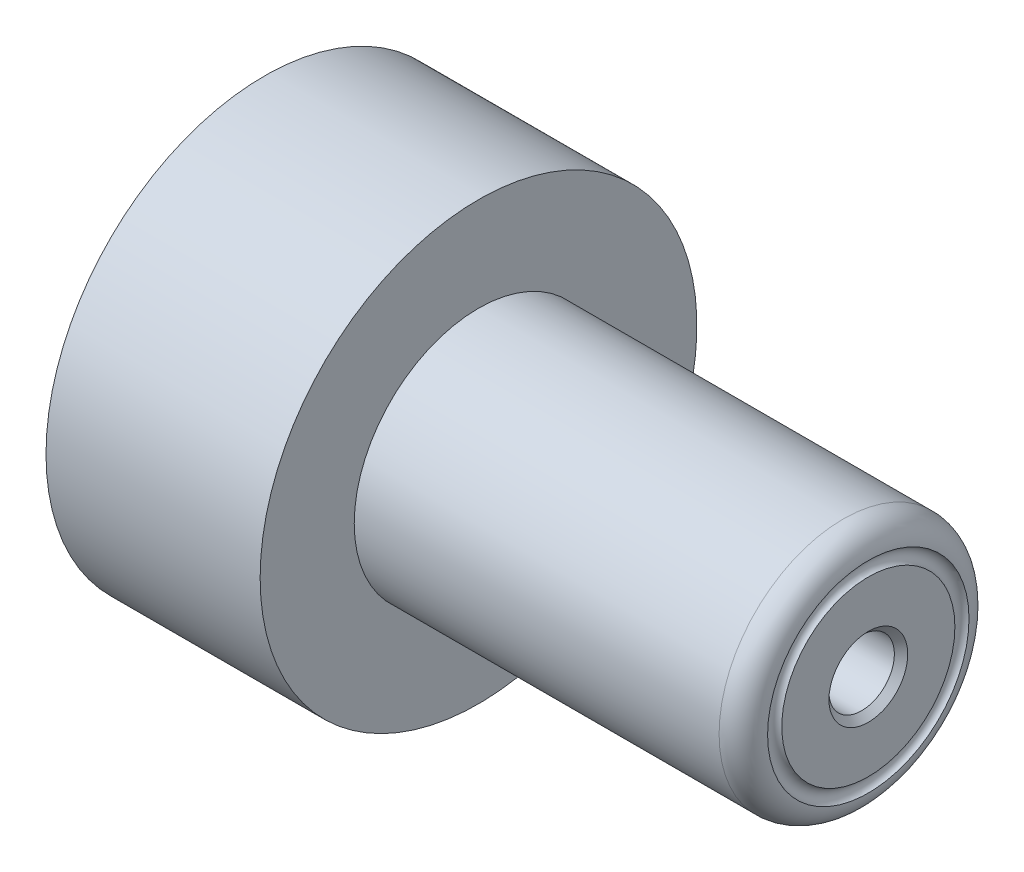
ISO-10303-21;
HEADER;
FILE_DESCRIPTION(('STEP AP214'),'2;1');
FILE_NAME('part.step','',(''),(''),'','','');
FILE_SCHEMA(('AUTOMOTIVE_DESIGN { 1 0 10303 214 1 1 1 1 }'));
ENDSEC;
DATA;
#1=APPLICATION_CONTEXT('core data for automotive mechanical design processes');
#2=APPLICATION_PROTOCOL_DEFINITION('international standard','automotive_design',2000,#1);
#3=PRODUCT_CONTEXT('',#1,'mechanical');
#4=PRODUCT('Part','Part','',(#3));
#5=PRODUCT_RELATED_PRODUCT_CATEGORY('part','',(#4));
#6=PRODUCT_DEFINITION_FORMATION('','',#4);
#7=PRODUCT_DEFINITION_CONTEXT('part definition',#1,'design');
#8=PRODUCT_DEFINITION('design','',#6,#7);
#9=PRODUCT_DEFINITION_SHAPE('','',#8);
#10=(LENGTH_UNIT() NAMED_UNIT(*) SI_UNIT(.MILLI.,.METRE.));
#11=(NAMED_UNIT(*) PLANE_ANGLE_UNIT() SI_UNIT($,.RADIAN.));
#12=(NAMED_UNIT(*) SI_UNIT($,.STERADIAN.) SOLID_ANGLE_UNIT());
#13=UNCERTAINTY_MEASURE_WITH_UNIT(LENGTH_MEASURE(1.E-05),#10,'distance_accuracy_value','');
#14=(GEOMETRIC_REPRESENTATION_CONTEXT(3) GLOBAL_UNCERTAINTY_ASSIGNED_CONTEXT((#13)) GLOBAL_UNIT_ASSIGNED_CONTEXT((#10,
#11,#12)) REPRESENTATION_CONTEXT('',''));
#15=CARTESIAN_POINT('',(0.,0.,0.));
#16=DIRECTION('',(0.,0.,1.));
#17=DIRECTION('',(1.,0.,0.));
#18=AXIS2_PLACEMENT_3D('',#15,#16,#17);
#19=CARTESIAN_POINT('',(30.734,5.0546,0.));
#20=DIRECTION('',(-1.,0.,0.));
#21=DIRECTION('',(0.,0.,1.));
#22=AXIS2_PLACEMENT_3D('',#19,#20,#21);
#23=PLANE('',#22);
#24=CARTESIAN_POINT('',(30.734,0.,0.));
#25=DIRECTION('',(-1.,0.,0.));
#26=DIRECTION('',(0.,0.,1.));
#27=AXIS2_PLACEMENT_3D('',#24,#25,#26);
#28=CIRCLE('',#27,2.005);
#29=CARTESIAN_POINT('',(30.734,0.,2.005));
#30=VERTEX_POINT('',#29);
#31=EDGE_CURVE('E10',#30,#30,#28,.T.);
#32=ORIENTED_EDGE('',*,*,#31,.T.);
#33=EDGE_LOOP('',(#32));
#34=FACE_BOUND('',#33,.T.);
#35=CARTESIAN_POINT('',(30.734,0.,0.));
#36=DIRECTION('',(1.,0.,0.));
#37=DIRECTION('',(0.,0.,-1.));
#38=AXIS2_PLACEMENT_3D('',#35,#36,#37);
#39=CIRCLE('',#38,4.4044004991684);
#40=CARTESIAN_POINT('',(30.734,0.,-4.4044004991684));
#41=VERTEX_POINT('',#40);
#42=EDGE_CURVE('E88',#41,#41,#39,.F.);
#43=ORIENTED_EDGE('',*,*,#42,.F.);
#44=EDGE_LOOP('',(#43));
#45=FACE_BOUND('',#44,.T.);
#46=ADVANCED_FACE('F39',(#34,#45),#23,.F.);
#47=CARTESIAN_POINT('',(29.464,0.,0.));
#48=DIRECTION('',(-1.,0.,0.));
#49=DIRECTION('',(0.,0.,1.));
#50=AXIS2_PLACEMENT_3D('',#47,#48,#49);
#51=TOROIDAL_SURFACE('',#50,5.0546,1.27);
#52=CARTESIAN_POINT('',(29.464,0.,0.));
#53=DIRECTION('',(-1.,0.,0.));
#54=DIRECTION('',(0.,0.,1.));
#55=AXIS2_PLACEMENT_3D('',#52,#53,#54);
#56=CIRCLE('',#55,6.3246);
#57=CARTESIAN_POINT('',(29.464,0.,6.3246));
#58=VERTEX_POINT('',#57);
#59=EDGE_CURVE('E56',#58,#58,#56,.T.);
#60=ORIENTED_EDGE('',*,*,#59,.F.);
#61=EDGE_LOOP('',(#60));
#62=FACE_BOUND('',#61,.T.);
#63=CARTESIAN_POINT('',(30.7320512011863,0.,0.));
#64=DIRECTION('',(1.,0.,0.));
#65=DIRECTION('',(0.,0.,-1.));
#66=AXIS2_PLACEMENT_3D('',#63,#64,#65);
#67=CIRCLE('',#66,5.1249288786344);
#68=CARTESIAN_POINT('',(30.7320512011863,0.,-5.1249288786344));
#69=VERTEX_POINT('',#68);
#70=EDGE_CURVE('E43',#69,#69,#67,.T.);
#71=ORIENTED_EDGE('',*,*,#70,.F.);
#72=EDGE_LOOP('',(#71));
#73=FACE_BOUND('',#72,.T.);
#74=ADVANCED_FACE('F97',(#62,#73),#51,.T.);
#75=CARTESIAN_POINT('',(0.,0.,0.));
#76=DIRECTION('',(-1.,0.,0.));
#77=DIRECTION('',(0.,0.,1.));
#78=AXIS2_PLACEMENT_3D('',#75,#76,#77);
#79=CYLINDRICAL_SURFACE('',#78,3.9751);
#80=CARTESIAN_POINT('',(21.8948,0.,0.));
#81=DIRECTION('',(-1.,0.,0.));
#82=DIRECTION('',(0.,0.,1.));
#83=AXIS2_PLACEMENT_3D('',#80,#81,#82);
#84=CIRCLE('',#83,3.9751);
#85=CARTESIAN_POINT('',(21.8948,0.,3.9751));
#86=VERTEX_POINT('',#85);
#87=EDGE_CURVE('E51',#86,#86,#84,.T.);
#88=ORIENTED_EDGE('',*,*,#87,.F.);
#89=EDGE_LOOP('',(#88));
#90=FACE_BOUND('',#89,.T.);
#91=CARTESIAN_POINT('',(0.,0.,0.));
#92=DIRECTION('',(-1.,0.,0.));
#93=DIRECTION('',(0.,0.,1.));
#94=AXIS2_PLACEMENT_3D('',#91,#92,#93);
#95=CIRCLE('',#94,3.9751);
#96=CARTESIAN_POINT('',(0.,0.,3.9751));
#97=VERTEX_POINT('',#96);
#98=EDGE_CURVE('E70',#97,#97,#95,.T.);
#99=ORIENTED_EDGE('',*,*,#98,.T.);
#100=EDGE_LOOP('',(#99));
#101=FACE_BOUND('',#100,.T.);
#102=ADVANCED_FACE('F99',(#90,#101),#79,.F.);
#103=CARTESIAN_POINT('',(21.8948,3.9751,0.));
#104=DIRECTION('',(1.,0.,0.));
#105=DIRECTION('',(0.,0.,-1.));
#106=AXIS2_PLACEMENT_3D('',#103,#104,#105);
#107=PLANE('',#106);
#108=CARTESIAN_POINT('',(21.8948,0.,0.));
#109=DIRECTION('',(1.,0.,0.));
#110=DIRECTION('',(0.,0.,-1.));
#111=AXIS2_PLACEMENT_3D('',#108,#109,#110);
#112=CIRCLE('',#111,1.665);
#113=CARTESIAN_POINT('',(21.8948,0.,-1.665));
#114=VERTEX_POINT('',#113);
#115=EDGE_CURVE('E83',#114,#114,#112,.T.);
#116=ORIENTED_EDGE('',*,*,#115,.T.);
#117=EDGE_LOOP('',(#116));
#118=FACE_BOUND('',#117,.T.);
#119=ORIENTED_EDGE('',*,*,#87,.T.);
#120=EDGE_LOOP('',(#119));
#121=FACE_BOUND('',#120,.T.);
#122=ADVANCED_FACE('F106',(#118,#121),#107,.F.);
#123=CARTESIAN_POINT('',(0.,0.,0.));
#124=DIRECTION('',(-1.,0.,0.));
#125=DIRECTION('',(0.,0.,1.));
#126=AXIS2_PLACEMENT_3D('',#123,#124,#125);
#127=CYLINDRICAL_SURFACE('',#126,6.3246);
#128=CARTESIAN_POINT('',(10.8966,0.,0.));
#129=DIRECTION('',(-1.,0.,0.));
#130=DIRECTION('',(0.,0.,1.));
#131=AXIS2_PLACEMENT_3D('',#128,#129,#130);
#132=CIRCLE('',#131,6.3246);
#133=CARTESIAN_POINT('',(10.8966,0.,6.3246));
#134=VERTEX_POINT('',#133);
#135=EDGE_CURVE('E59',#134,#134,#132,.T.);
#136=ORIENTED_EDGE('',*,*,#135,.F.);
#137=EDGE_LOOP('',(#136));
#138=FACE_BOUND('',#137,.T.);
#139=ORIENTED_EDGE('',*,*,#59,.T.);
#140=EDGE_LOOP('',(#139));
#141=FACE_BOUND('',#140,.T.);
#142=ADVANCED_FACE('F111',(#138,#141),#127,.T.);
#143=CARTESIAN_POINT('',(10.8966,11.1125,0.));
#144=DIRECTION('',(-1.,0.,0.));
#145=DIRECTION('',(0.,0.,1.));
#146=AXIS2_PLACEMENT_3D('',#143,#144,#145);
#147=PLANE('',#146);
#148=CARTESIAN_POINT('',(10.8966,0.,0.));
#149=DIRECTION('',(-1.,0.,0.));
#150=DIRECTION('',(0.,0.,1.));
#151=AXIS2_PLACEMENT_3D('',#148,#149,#150);
#152=CIRCLE('',#151,11.1125);
#153=CARTESIAN_POINT('',(10.8966,0.,11.1125));
#154=VERTEX_POINT('',#153);
#155=EDGE_CURVE('E62',#154,#154,#152,.T.);
#156=ORIENTED_EDGE('',*,*,#155,.F.);
#157=EDGE_LOOP('',(#156));
#158=FACE_BOUND('',#157,.T.);
#159=ORIENTED_EDGE('',*,*,#135,.T.);
#160=EDGE_LOOP('',(#159));
#161=FACE_BOUND('',#160,.T.);
#162=ADVANCED_FACE('F119',(#158,#161),#147,.F.);
#163=CARTESIAN_POINT('',(0.,0.,0.));
#164=DIRECTION('',(-1.,0.,0.));
#165=DIRECTION('',(0.,0.,1.));
#166=AXIS2_PLACEMENT_3D('',#163,#164,#165);
#167=CYLINDRICAL_SURFACE('',#166,11.1125);
#168=CARTESIAN_POINT('',(0.,0.,0.));
#169=DIRECTION('',(-1.,0.,0.));
#170=DIRECTION('',(0.,0.,1.));
#171=AXIS2_PLACEMENT_3D('',#168,#169,#170);
#172=CIRCLE('',#171,11.1125);
#173=CARTESIAN_POINT('',(0.,0.,11.1125));
#174=VERTEX_POINT('',#173);
#175=EDGE_CURVE('E66',#174,#174,#172,.T.);
#176=ORIENTED_EDGE('',*,*,#175,.F.);
#177=EDGE_LOOP('',(#176));
#178=FACE_BOUND('',#177,.T.);
#179=ORIENTED_EDGE('',*,*,#155,.T.);
#180=EDGE_LOOP('',(#179));
#181=FACE_BOUND('',#180,.T.);
#182=ADVANCED_FACE('F131',(#178,#181),#167,.T.);
#183=CARTESIAN_POINT('',(0.,3.9751,0.));
#184=DIRECTION('',(1.,0.,0.));
#185=DIRECTION('',(0.,0.,-1.));
#186=AXIS2_PLACEMENT_3D('',#183,#184,#185);
#187=PLANE('',#186);
#188=CARTESIAN_POINT('',(0.,0.,6.7437));
#189=DIRECTION('',(-1.,0.,0.));
#190=DIRECTION('',(0.,0.,-1.));
#191=AXIS2_PLACEMENT_3D('',#188,#189,#190);
#192=CIRCLE('',#191,1.2065);
#193=CARTESIAN_POINT('',(0.,0.,5.5372));
#194=VERTEX_POINT('',#193);
#195=EDGE_CURVE('E80',#194,#194,#192,.T.);
#196=ORIENTED_EDGE('',*,*,#195,.F.);
#197=EDGE_LOOP('',(#196));
#198=FACE_BOUND('',#197,.T.);
#199=CARTESIAN_POINT('',(0.,0.,-6.7437));
#200=DIRECTION('',(-1.,0.,0.));
#201=DIRECTION('',(0.,0.,1.));
#202=AXIS2_PLACEMENT_3D('',#199,#200,#201);
#203=CIRCLE('',#202,1.2065);
#204=CARTESIAN_POINT('',(0.,0.,-5.5372));
#205=VERTEX_POINT('',#204);
#206=EDGE_CURVE('E74',#205,#205,#203,.T.);
#207=ORIENTED_EDGE('',*,*,#206,.F.);
#208=EDGE_LOOP('',(#207));
#209=FACE_BOUND('',#208,.T.);
#210=ORIENTED_EDGE('',*,*,#98,.F.);
#211=EDGE_LOOP('',(#210));
#212=FACE_BOUND('',#211,.T.);
#213=ORIENTED_EDGE('',*,*,#175,.T.);
#214=EDGE_LOOP('',(#213));
#215=FACE_BOUND('',#214,.T.);
#216=ADVANCED_FACE('F127',(#198,#209,#212,#215),#187,.F.);
#217=CARTESIAN_POINT('',(2.54,0.,-6.7437));
#218=DIRECTION('',(-1.,0.,0.));
#219=DIRECTION('',(0.,0.,1.));
#220=AXIS2_PLACEMENT_3D('',#217,#218,#219);
#221=CYLINDRICAL_SURFACE('',#220,1.2065);
#222=CARTESIAN_POINT('',(2.54,0.,-6.7437));
#223=DIRECTION('',(-1.,0.,0.));
#224=DIRECTION('',(0.,0.,1.));
#225=AXIS2_PLACEMENT_3D('',#222,#223,#224);
#226=CIRCLE('',#225,1.2065);
#227=CARTESIAN_POINT('',(2.54,0.,-5.5372));
#228=VERTEX_POINT('',#227);
#229=EDGE_CURVE('E73',#228,#228,#226,.T.);
#230=ORIENTED_EDGE('',*,*,#229,.F.);
#231=EDGE_LOOP('',(#230));
#232=FACE_BOUND('',#231,.T.);
#233=ORIENTED_EDGE('',*,*,#206,.T.);
#234=EDGE_LOOP('',(#233));
#235=FACE_BOUND('',#234,.T.);
#236=ADVANCED_FACE('F130',(#232,#235),#221,.F.);
#237=CARTESIAN_POINT('',(2.54,0.,-6.7437));
#238=DIRECTION('',(-1.,0.,0.));
#239=DIRECTION('',(0.,0.,1.));
#240=AXIS2_PLACEMENT_3D('',#237,#238,#239);
#241=PLANE('',#240);
#242=ORIENTED_EDGE('',*,*,#229,.T.);
#243=EDGE_LOOP('',(#242));
#244=FACE_BOUND('',#243,.T.);
#245=ADVANCED_FACE('F150',(#244),#241,.T.);
#246=CARTESIAN_POINT('',(2.54,0.,6.7437));
#247=DIRECTION('',(-1.,0.,0.));
#248=DIRECTION('',(0.,0.,1.));
#249=AXIS2_PLACEMENT_3D('',#246,#247,#248);
#250=CYLINDRICAL_SURFACE('',#249,1.2065);
#251=CARTESIAN_POINT('',(2.54,0.,6.7437));
#252=DIRECTION('',(-1.,0.,0.));
#253=DIRECTION('',(0.,0.,-1.));
#254=AXIS2_PLACEMENT_3D('',#251,#252,#253);
#255=CIRCLE('',#254,1.2065);
#256=CARTESIAN_POINT('',(2.54,0.,5.5372));
#257=VERTEX_POINT('',#256);
#258=EDGE_CURVE('E77',#257,#257,#255,.T.);
#259=ORIENTED_EDGE('',*,*,#258,.F.);
#260=EDGE_LOOP('',(#259));
#261=FACE_BOUND('',#260,.T.);
#262=ORIENTED_EDGE('',*,*,#195,.T.);
#263=EDGE_LOOP('',(#262));
#264=FACE_BOUND('',#263,.T.);
#265=ADVANCED_FACE('F154',(#261,#264),#250,.F.);
#266=CARTESIAN_POINT('',(2.54,0.,6.7437));
#267=DIRECTION('',(1.,0.,0.));
#268=DIRECTION('',(0.,0.,-1.));
#269=AXIS2_PLACEMENT_3D('',#266,#267,#268);
#270=PLANE('',#269);
#271=ORIENTED_EDGE('',*,*,#258,.T.);
#272=EDGE_LOOP('',(#271));
#273=FACE_BOUND('',#272,.T.);
#274=ADVANCED_FACE('F158',(#273),#270,.F.);
#275=CARTESIAN_POINT('',(0.,0.,0.));
#276=DIRECTION('',(1.,0.,0.));
#277=DIRECTION('',(0.,0.,-1.));
#278=AXIS2_PLACEMENT_3D('',#275,#276,#277);
#279=CYLINDRICAL_SURFACE('',#278,1.665);
#280=CARTESIAN_POINT('',(30.394,0.,0.));
#281=DIRECTION('',(-1.,0.,0.));
#282=DIRECTION('',(0.,0.,1.));
#283=AXIS2_PLACEMENT_3D('',#280,#281,#282);
#284=CIRCLE('',#283,1.665);
#285=CARTESIAN_POINT('',(30.394,0.,1.665));
#286=VERTEX_POINT('',#285);
#287=EDGE_CURVE('E47',#286,#286,#284,.F.);
#288=ORIENTED_EDGE('',*,*,#287,.T.);
#289=EDGE_LOOP('',(#288));
#290=FACE_BOUND('',#289,.T.);
#291=ORIENTED_EDGE('',*,*,#115,.F.);
#292=EDGE_LOOP('',(#291));
#293=FACE_BOUND('',#292,.T.);
#294=ADVANCED_FACE('F162',(#290,#293),#279,.F.);
#295=CARTESIAN_POINT('',(30.394,0.,0.));
#296=DIRECTION('',(1.,0.,0.));
#297=DIRECTION('',(0.,0.,-1.));
#298=AXIS2_PLACEMENT_3D('',#295,#296,#297);
#299=CONICAL_SURFACE('',#298,1.665,0.785398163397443);
#300=ORIENTED_EDGE('',*,*,#31,.F.);
#301=EDGE_LOOP('',(#300));
#302=FACE_BOUND('',#301,.T.);
#303=ORIENTED_EDGE('',*,*,#287,.F.);
#304=EDGE_LOOP('',(#303));
#305=FACE_BOUND('',#304,.T.);
#306=ADVANCED_FACE('F41',(#302,#305),#299,.F.);
#307=CARTESIAN_POINT('',(30.857,0.,0.));
#308=DIRECTION('',(-1.,0.,0.));
#309=DIRECTION('',(0.,0.,1.));
#310=AXIS2_PLACEMENT_3D('',#307,#308,#309);
#311=TOROIDAL_SURFACE('',#310,4.765,0.380999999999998);
#312=ORIENTED_EDGE('',*,*,#70,.T.);
#313=EDGE_LOOP('',(#312));
#314=FACE_BOUND('',#313,.T.);
#315=ORIENTED_EDGE('',*,*,#42,.T.);
#316=EDGE_LOOP('',(#315));
#317=FACE_BOUND('',#316,.T.);
#318=ADVANCED_FACE('F95',(#314,#317),#311,.F.);
#319=CLOSED_SHELL('',(#46,#74,#102,#122,#142,#162,#182,#216,#236,#245,#265,#274,#294,#306,#318));
#320=MANIFOLD_SOLID_BREP('B2',#319);
#321=ADVANCED_BREP_SHAPE_REPRESENTATION('',(#18,#320),#14);
#322=SHAPE_DEFINITION_REPRESENTATION(#9,#321);
ENDSEC;
END-ISO-10303-21;
